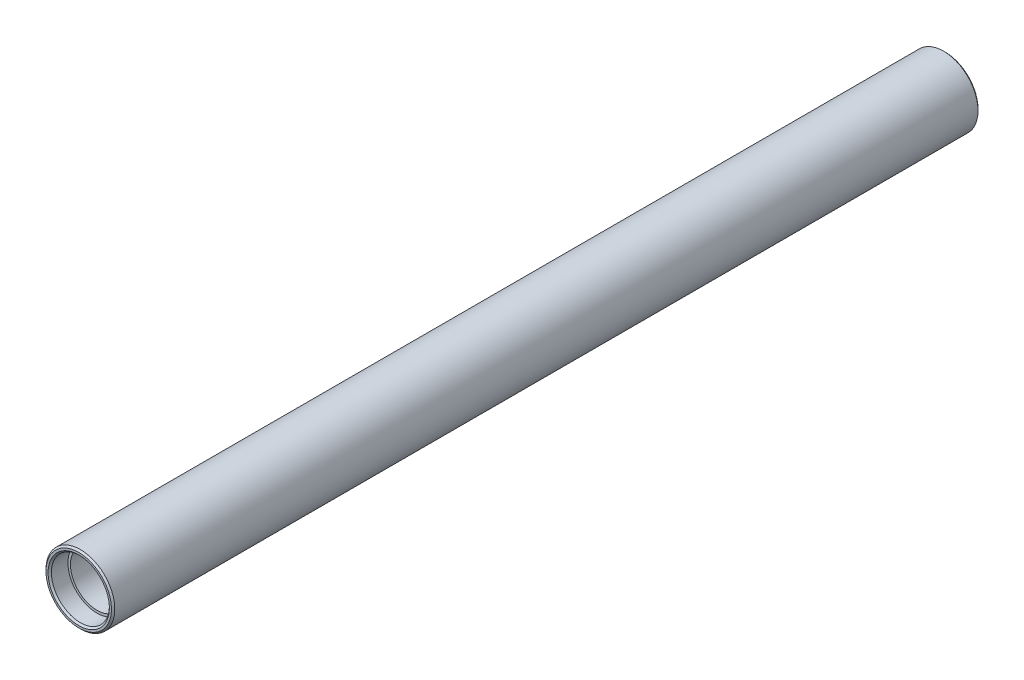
ISO-10303-21;
HEADER;
FILE_DESCRIPTION(('STEP AP214'),'2;1');
FILE_NAME('part.step','',(''),(''),'','','');
FILE_SCHEMA(('AUTOMOTIVE_DESIGN { 1 0 10303 214 1 1 1 1 }'));
ENDSEC;
DATA;
#1=APPLICATION_CONTEXT('core data for automotive mechanical design processes');
#2=APPLICATION_PROTOCOL_DEFINITION('international standard','automotive_design',2000,#1);
#3=PRODUCT_CONTEXT('',#1,'mechanical');
#4=PRODUCT('Part','Part','',(#3));
#5=PRODUCT_RELATED_PRODUCT_CATEGORY('part','',(#4));
#6=PRODUCT_DEFINITION_FORMATION('','',#4);
#7=PRODUCT_DEFINITION_CONTEXT('part definition',#1,'design');
#8=PRODUCT_DEFINITION('design','',#6,#7);
#9=PRODUCT_DEFINITION_SHAPE('','',#8);
#10=(LENGTH_UNIT() NAMED_UNIT(*) SI_UNIT(.MILLI.,.METRE.));
#11=(NAMED_UNIT(*) PLANE_ANGLE_UNIT() SI_UNIT($,.RADIAN.));
#12=(NAMED_UNIT(*) SI_UNIT($,.STERADIAN.) SOLID_ANGLE_UNIT());
#13=UNCERTAINTY_MEASURE_WITH_UNIT(LENGTH_MEASURE(1.E-05),#10,'distance_accuracy_value','');
#14=(GEOMETRIC_REPRESENTATION_CONTEXT(3) GLOBAL_UNCERTAINTY_ASSIGNED_CONTEXT((#13)) GLOBAL_UNIT_ASSIGNED_CONTEXT((#10,
#11,#12)) REPRESENTATION_CONTEXT('',''));
#15=CARTESIAN_POINT('',(0.,0.,0.));
#16=DIRECTION('',(0.,0.,1.));
#17=DIRECTION('',(1.,0.,0.));
#18=AXIS2_PLACEMENT_3D('',#15,#16,#17);
#19=CARTESIAN_POINT('',(0.,0.,261.5));
#20=DIRECTION('',(0.,0.,-1.));
#21=DIRECTION('',(-1.,0.,0.));
#22=AXIS2_PLACEMENT_3D('',#19,#20,#21);
#23=CYLINDRICAL_SURFACE('',#22,16.);
#24=CARTESIAN_POINT('',(0.,0.,11.));
#25=DIRECTION('',(0.,0.,-1.));
#26=DIRECTION('',(-1.,0.,0.));
#27=AXIS2_PLACEMENT_3D('',#24,#25,#26);
#28=CIRCLE('',#27,16.);
#29=CARTESIAN_POINT('',(-16.,0.,11.));
#30=VERTEX_POINT('',#29);
#31=EDGE_CURVE('E80',#30,#30,#28,.T.);
#32=ORIENTED_EDGE('',*,*,#31,.T.);
#33=EDGE_LOOP('',(#32));
#34=FACE_BOUND('',#33,.T.);
#35=CARTESIAN_POINT('',(0.,0.,512.));
#36=DIRECTION('',(0.,0.,1.));
#37=DIRECTION('',(1.,0.,0.));
#38=AXIS2_PLACEMENT_3D('',#35,#36,#37);
#39=CIRCLE('',#38,16.);
#40=CARTESIAN_POINT('',(16.,0.,512.));
#41=VERTEX_POINT('',#40);
#42=EDGE_CURVE('E64',#41,#41,#39,.T.);
#43=ORIENTED_EDGE('',*,*,#42,.T.);
#44=EDGE_LOOP('',(#43));
#45=FACE_BOUND('',#44,.T.);
#46=ADVANCED_FACE('F40',(#34,#45),#23,.F.);
#47=CARTESIAN_POINT('',(0.,0.,523.));
#48=DIRECTION('',(0.,0.,-1.));
#49=DIRECTION('',(1.,0.,0.));
#50=AXIS2_PLACEMENT_3D('',#47,#48,#49);
#51=PLANE('',#50);
#52=CARTESIAN_POINT('',(0.,0.,523.));
#53=DIRECTION('',(0.,0.,-1.));
#54=DIRECTION('',(-1.,0.,0.));
#55=AXIS2_PLACEMENT_3D('',#52,#53,#54);
#56=CIRCLE('',#55,18.5);
#57=CARTESIAN_POINT('',(-18.5,0.,523.));
#58=VERTEX_POINT('',#57);
#59=EDGE_CURVE('E54',#58,#58,#56,.T.);
#60=ORIENTED_EDGE('',*,*,#59,.T.);
#61=EDGE_LOOP('',(#60));
#62=FACE_BOUND('',#61,.T.);
#63=CARTESIAN_POINT('',(0.,0.,523.));
#64=DIRECTION('',(0.,0.,-1.));
#65=DIRECTION('',(-1.,0.,0.));
#66=AXIS2_PLACEMENT_3D('',#63,#64,#65);
#67=CIRCLE('',#66,19.75);
#68=CARTESIAN_POINT('',(-19.75,0.,523.));
#69=VERTEX_POINT('',#68);
#70=EDGE_CURVE('E58',#69,#69,#67,.F.);
#71=ORIENTED_EDGE('',*,*,#70,.T.);
#72=EDGE_LOOP('',(#71));
#73=FACE_BOUND('',#72,.T.);
#74=ADVANCED_FACE('F104',(#62,#73),#51,.F.);
#75=CARTESIAN_POINT('',(0.,0.,0.));
#76=DIRECTION('',(0.,0.,1.));
#77=DIRECTION('',(1.,0.,0.));
#78=AXIS2_PLACEMENT_3D('',#75,#76,#77);
#79=PLANE('',#78);
#80=CARTESIAN_POINT('',(0.,0.,0.));
#81=DIRECTION('',(0.,0.,1.));
#82=DIRECTION('',(1.,0.,0.));
#83=AXIS2_PLACEMENT_3D('',#80,#81,#82);
#84=CIRCLE('',#83,18.4999999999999);
#85=CARTESIAN_POINT('',(18.4999999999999,0.,0.));
#86=VERTEX_POINT('',#85);
#87=EDGE_CURVE('E71',#86,#86,#84,.T.);
#88=ORIENTED_EDGE('',*,*,#87,.T.);
#89=EDGE_LOOP('',(#88));
#90=FACE_BOUND('',#89,.T.);
#91=CARTESIAN_POINT('',(0.,0.,0.));
#92=DIRECTION('',(0.,0.,1.));
#93=DIRECTION('',(1.,0.,0.));
#94=AXIS2_PLACEMENT_3D('',#91,#92,#93);
#95=CIRCLE('',#94,19.75);
#96=CARTESIAN_POINT('',(19.75,0.,0.));
#97=VERTEX_POINT('',#96);
#98=EDGE_CURVE('E74',#97,#97,#95,.F.);
#99=ORIENTED_EDGE('',*,*,#98,.T.);
#100=EDGE_LOOP('',(#99));
#101=FACE_BOUND('',#100,.T.);
#102=ADVANCED_FACE('F110',(#90,#101),#79,.F.);
#103=CARTESIAN_POINT('',(0.,0.,261.5));
#104=DIRECTION('',(0.,0.,-1.));
#105=DIRECTION('',(-1.,0.,0.));
#106=AXIS2_PLACEMENT_3D('',#103,#104,#105);
#107=CYLINDRICAL_SURFACE('',#106,20.75);
#108=CARTESIAN_POINT('',(0.,0.,522.));
#109=DIRECTION('',(0.,0.,-1.));
#110=DIRECTION('',(-1.,0.,0.));
#111=AXIS2_PLACEMENT_3D('',#108,#109,#110);
#112=CIRCLE('',#111,20.75);
#113=CARTESIAN_POINT('',(-20.75,0.,522.));
#114=VERTEX_POINT('',#113);
#115=EDGE_CURVE('E11',#114,#114,#112,.T.);
#116=ORIENTED_EDGE('',*,*,#115,.T.);
#117=EDGE_LOOP('',(#116));
#118=FACE_BOUND('',#117,.T.);
#119=CARTESIAN_POINT('',(0.,0.,1.00000000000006));
#120=DIRECTION('',(0.,0.,1.));
#121=DIRECTION('',(1.,0.,0.));
#122=AXIS2_PLACEMENT_3D('',#119,#120,#121);
#123=CIRCLE('',#122,20.75);
#124=CARTESIAN_POINT('',(20.75,0.,1.00000000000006));
#125=VERTEX_POINT('',#124);
#126=EDGE_CURVE('E63',#125,#125,#123,.T.);
#127=ORIENTED_EDGE('',*,*,#126,.T.);
#128=EDGE_LOOP('',(#127));
#129=FACE_BOUND('',#128,.T.);
#130=ADVANCED_FACE('F120',(#118,#129),#107,.T.);
#131=CARTESIAN_POINT('',(0.,0.,11.));
#132=DIRECTION('',(0.,0.,-1.));
#133=DIRECTION('',(-1.,0.,0.));
#134=AXIS2_PLACEMENT_3D('',#131,#132,#133);
#135=CYLINDRICAL_SURFACE('',#134,17.5);
#136=CARTESIAN_POINT('',(0.,0.,0.999999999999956));
#137=DIRECTION('',(0.,0.,1.));
#138=DIRECTION('',(1.,0.,0.));
#139=AXIS2_PLACEMENT_3D('',#136,#137,#138);
#140=CIRCLE('',#139,17.5);
#141=CARTESIAN_POINT('',(17.5,0.,0.999999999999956));
#142=VERTEX_POINT('',#141);
#143=EDGE_CURVE('E77',#142,#142,#140,.F.);
#144=ORIENTED_EDGE('',*,*,#143,.T.);
#145=EDGE_LOOP('',(#144));
#146=FACE_BOUND('',#145,.T.);
#147=CARTESIAN_POINT('',(0.,0.,11.));
#148=DIRECTION('',(0.,0.,-1.));
#149=DIRECTION('',(-1.,0.,0.));
#150=AXIS2_PLACEMENT_3D('',#147,#148,#149);
#151=CIRCLE('',#150,17.5);
#152=CARTESIAN_POINT('',(-17.5,0.,11.));
#153=VERTEX_POINT('',#152);
#154=EDGE_CURVE('E67',#153,#153,#151,.T.);
#155=ORIENTED_EDGE('',*,*,#154,.F.);
#156=EDGE_LOOP('',(#155));
#157=FACE_BOUND('',#156,.T.);
#158=ADVANCED_FACE('F116',(#146,#157),#135,.F.);
#159=CARTESIAN_POINT('',(0.,0.,11.));
#160=DIRECTION('',(0.,0.,-1.));
#161=DIRECTION('',(-1.,0.,0.));
#162=AXIS2_PLACEMENT_3D('',#159,#160,#161);
#163=PLANE('',#162);
#164=ORIENTED_EDGE('',*,*,#31,.F.);
#165=EDGE_LOOP('',(#164));
#166=FACE_BOUND('',#165,.T.);
#167=ORIENTED_EDGE('',*,*,#154,.T.);
#168=EDGE_LOOP('',(#167));
#169=FACE_BOUND('',#168,.T.);
#170=ADVANCED_FACE('F127',(#166,#169),#163,.T.);
#171=CARTESIAN_POINT('',(0.,0.,0.999999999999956));
#172=DIRECTION('',(0.,0.,-1.));
#173=DIRECTION('',(-1.,0.,0.));
#174=AXIS2_PLACEMENT_3D('',#171,#172,#173);
#175=CONICAL_SURFACE('',#174,17.5,0.785398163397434);
#176=ORIENTED_EDGE('',*,*,#87,.F.);
#177=EDGE_LOOP('',(#176));
#178=FACE_BOUND('',#177,.T.);
#179=ORIENTED_EDGE('',*,*,#143,.F.);
#180=EDGE_LOOP('',(#179));
#181=FACE_BOUND('',#180,.T.);
#182=ADVANCED_FACE('F124',(#178,#181),#175,.F.);
#183=CARTESIAN_POINT('',(0.,0.,1.00000000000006));
#184=DIRECTION('',(0.,0.,1.));
#185=DIRECTION('',(1.,0.,0.));
#186=AXIS2_PLACEMENT_3D('',#183,#184,#185);
#187=CONICAL_SURFACE('',#186,20.75,0.78539816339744);
#188=ORIENTED_EDGE('',*,*,#98,.F.);
#189=EDGE_LOOP('',(#188));
#190=FACE_BOUND('',#189,.T.);
#191=ORIENTED_EDGE('',*,*,#126,.F.);
#192=EDGE_LOOP('',(#191));
#193=FACE_BOUND('',#192,.T.);
#194=ADVANCED_FACE('F100',(#190,#193),#187,.T.);
#195=CARTESIAN_POINT('',(0.,0.,512.));
#196=DIRECTION('',(0.,0.,1.));
#197=DIRECTION('',(1.,0.,0.));
#198=AXIS2_PLACEMENT_3D('',#195,#196,#197);
#199=CYLINDRICAL_SURFACE('',#198,17.5);
#200=CARTESIAN_POINT('',(0.,0.,522.));
#201=DIRECTION('',(0.,0.,-1.));
#202=DIRECTION('',(-1.,0.,0.));
#203=AXIS2_PLACEMENT_3D('',#200,#201,#202);
#204=CIRCLE('',#203,17.5);
#205=CARTESIAN_POINT('',(-17.5,0.,522.));
#206=VERTEX_POINT('',#205);
#207=EDGE_CURVE('E49',#206,#206,#204,.F.);
#208=ORIENTED_EDGE('',*,*,#207,.T.);
#209=EDGE_LOOP('',(#208));
#210=FACE_BOUND('',#209,.T.);
#211=CARTESIAN_POINT('',(0.,0.,512.));
#212=DIRECTION('',(0.,0.,-1.));
#213=DIRECTION('',(-1.,0.,0.));
#214=AXIS2_PLACEMENT_3D('',#211,#212,#213);
#215=CIRCLE('',#214,17.5);
#216=CARTESIAN_POINT('',(-17.5,0.,512.));
#217=VERTEX_POINT('',#216);
#218=EDGE_CURVE('E68',#217,#217,#215,.T.);
#219=ORIENTED_EDGE('',*,*,#218,.T.);
#220=EDGE_LOOP('',(#219));
#221=FACE_BOUND('',#220,.T.);
#222=ADVANCED_FACE('F88',(#210,#221),#199,.F.);
#223=CARTESIAN_POINT('',(0.,0.,512.));
#224=DIRECTION('',(0.,0.,1.));
#225=DIRECTION('',(-1.,0.,0.));
#226=AXIS2_PLACEMENT_3D('',#223,#224,#225);
#227=PLANE('',#226);
#228=ORIENTED_EDGE('',*,*,#42,.F.);
#229=EDGE_LOOP('',(#228));
#230=FACE_BOUND('',#229,.T.);
#231=ORIENTED_EDGE('',*,*,#218,.F.);
#232=EDGE_LOOP('',(#231));
#233=FACE_BOUND('',#232,.T.);
#234=ADVANCED_FACE('F90',(#230,#233),#227,.T.);
#235=CARTESIAN_POINT('',(0.,0.,523.));
#236=DIRECTION('',(0.,0.,1.));
#237=DIRECTION('',(1.,0.,0.));
#238=AXIS2_PLACEMENT_3D('',#235,#236,#237);
#239=CONICAL_SURFACE('',#238,18.5,0.785398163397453);
#240=ORIENTED_EDGE('',*,*,#207,.F.);
#241=EDGE_LOOP('',(#240));
#242=FACE_BOUND('',#241,.T.);
#243=ORIENTED_EDGE('',*,*,#59,.F.);
#244=EDGE_LOOP('',(#243));
#245=FACE_BOUND('',#244,.T.);
#246=ADVANCED_FACE('F92',(#242,#245),#239,.F.);
#247=CARTESIAN_POINT('',(0.,0.,523.));
#248=DIRECTION('',(0.,0.,-1.));
#249=DIRECTION('',(-1.,0.,0.));
#250=AXIS2_PLACEMENT_3D('',#247,#248,#249);
#251=CONICAL_SURFACE('',#250,19.75,0.785398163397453);
#252=ORIENTED_EDGE('',*,*,#115,.F.);
#253=EDGE_LOOP('',(#252));
#254=FACE_BOUND('',#253,.T.);
#255=ORIENTED_EDGE('',*,*,#70,.F.);
#256=EDGE_LOOP('',(#255));
#257=FACE_BOUND('',#256,.T.);
#258=ADVANCED_FACE('F42',(#254,#257),#251,.T.);
#259=CLOSED_SHELL('',(#46,#74,#102,#130,#158,#170,#182,#194,#222,#234,#246,#258));
#260=MANIFOLD_SOLID_BREP('B2',#259);
#261=ADVANCED_BREP_SHAPE_REPRESENTATION('',(#18,#260),#14);
#262=SHAPE_DEFINITION_REPRESENTATION(#9,#261);
ENDSEC;
END-ISO-10303-21;
